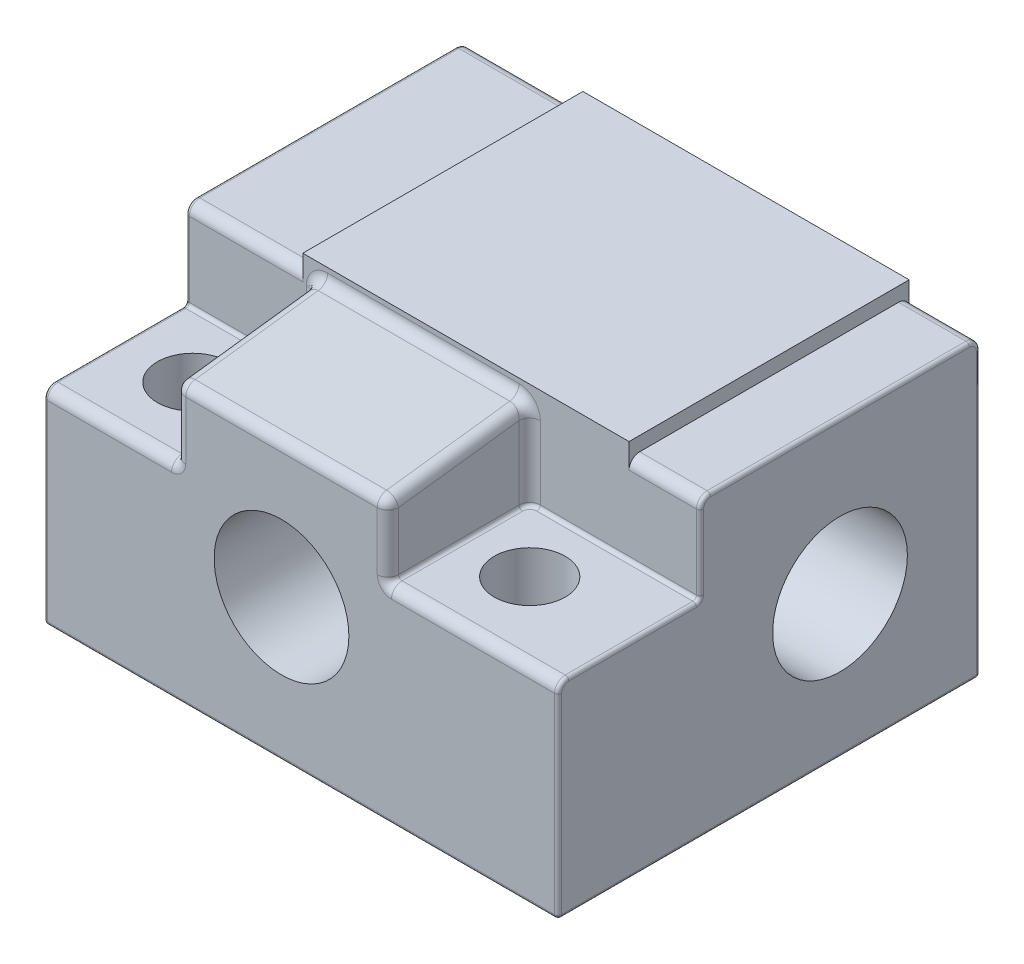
from build123d import *
from OCP.BRepFilletAPI import BRepFilletAPI_MakeFillet

# Parameters (mm, degrees)
SKETCH1_W          = 18.415
SKETCH1_H          = 15.113
EXTRUDE1_DEPTH     = 10.541
SKETCH2_W          = 6.096
SKETCH2_H          = 5.08
SKETCH2_W_2        = 4.699
CUT_EXTRUDE1_DEPTH = 3.175
SKETCH3_R          = 1.27
CUT_EXTRUDE2_DEPTH = 25.935375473
SKETCH4_W          = 11.684
SKETCH4_H          = 10.033
EXTRUDE2_DEPTH     = 0.508
SKETCH5_R          = 2.413
CUT_EXTRUDE3_DEPTH = 5.842
SKETCH6_R          = 2.413
CUT_EXTRUDE4_DEPTH = 27.260148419
CUT_EXTRUDE5_DEPTH = 27.260148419
FILLET1_R1         = 0.127
FILLET1_R2         = 0.381


with BuildPart() as part:
    # Sketch1 → Extrude1 (new body)
    with BuildSketch(Plane(origin=(0, 0, 0), x_dir=(1, 0, 0), z_dir=(0, 1, 0))):
        with Locations((9.2075, 7.5565)):
            Rectangle(SKETCH1_W, SKETCH1_H)
    extrude(amount=EXTRUDE1_DEPTH)

    # Sketch2 → Cut-Extrude1 (cut)
    with BuildSketch(Plane(origin=(0, 10.541, 0), x_dir=(-1, 0, 0), z_dir=(0, 1, 0))):
        with Locations((-15.367, -2.54)):
            Rectangle(SKETCH2_W, SKETCH2_H)
        with Locations((-2.3495, -2.54)):
            Rectangle(SKETCH2_W_2, SKETCH2_H)
    extrude(amount=-CUT_EXTRUDE1_DEPTH, mode=Mode.SUBTRACT)

    # Sketch3 → Cut-Extrude2 (cut, through all)
    with BuildSketch(Plane(origin=(0, 7.366, 0), x_dir=(-1, 0, 0), z_dir=(0, 1, 0))):
        with Locations(Location((-2.54, -2.794, 0), (0, 0, 90))):
            Circle(SKETCH3_R)
        with Locations(Location((-14.605, -2.794, 0), (0, 0, 90))):
            Circle(SKETCH3_R)
    extrude(amount=-CUT_EXTRUDE2_DEPTH, mode=Mode.SUBTRACT)

    # Sketch4 → Extrude2 (add)
    with BuildSketch(Plane(origin=(0, 10.541, 0), x_dir=(-1, 0, 0), z_dir=(0, 1, 0))):
        with Locations((-10.033, -10.0965)):
            Rectangle(SKETCH4_W, SKETCH4_H)
    extrude(amount=EXTRUDE2_DEPTH)

    # Sketch5 → Cut-Extrude3 (cut)
    with BuildSketch(Plane.XY):
        with Locations((8.509, 5.08)):
            Circle(SKETCH5_R)
    extrude(amount=-CUT_EXTRUDE3_DEPTH, mode=Mode.SUBTRACT)

    # Sketch6 → Cut-Extrude4 (cut, through all)
    with BuildSketch(Plane(origin=(18.415, 0, 0), x_dir=(0, 0, -1), z_dir=(1, 0, 0))):
        with Locations((10.0965, 5.08)):
            Circle(SKETCH6_R)
    extrude(amount=-CUT_EXTRUDE4_DEPTH, mode=Mode.SUBTRACT)

    # Sketch7 → Cut-Extrude5 (cut, through all)
    with BuildSketch(Plane(origin=(0, 0, 0), x_dir=(0, 0, -1), z_dir=(1, 0, 0))):
        Polygon((5.08, 10.541), (0, 9.906), (0, 10.541), align=None)
    extrude(amount=CUT_EXTRUDE5_DEPTH, mode=Mode.SUBTRACT)

    # Fillet1: one fillet with a radius per group of edges: ONE call of the kernel's fillet builder (fillet() takes one radius for all edges)
    fillet1_edges_1 = [part.edges().sort_by_distance(p)[0] for p in [
        (18.415, 10.541, -10.0965),
        (18.415, 3.683, 0),
        (18.415, 7.366, -2.54),
        (18.415, 8.9535, -5.08),
        (12.319, 7.366, -2.54),
        (15.367, 7.366, -5.08),
        (0, 3.683, 0),
        (0, 7.366, -2.54),
        (2.3495, 7.366, -5.08),
        (0, 8.9535, -5.08),
        (4.699, 7.366, -2.54),
        (0, 10.541, -10.0965),
        (9.2075, 0, -15.113),
        (18.415, 0, -7.5565),
        (9.2075, 0, 0),
        (0, 0, -7.5565),
        (0, 5.2705, -15.113),
        (18.415, 5.2705, -15.113),
    ]]
    fillet1_edges_2 = [part.edges().sort_by_distance(p)[0] for p in [
        (17.145, 10.541, -15.113),
        (15.367, 7.366, 0),
        (12.319, 8.636, 0),
        (12.319, 8.9535, -5.08),
        (17.145, 10.541, -5.08),
        (4.699, 8.9535, -5.08),
        (2.3495, 7.366, 0),
        (4.699, 8.636, 0),
        (2.0955, 10.541, -5.08),
        (2.0955, 10.541, -15.113),
        (8.509, 10.541, -5.08),
        (8.509, 9.906, 0),
        (12.319, 10.2235, -2.54),
        (4.699, 10.2235, -2.54),
    ]]
    fillet1 = BRepFilletAPI_MakeFillet(part.part.solid().wrapped)
    for e in fillet1_edges_1:
        fillet1.Add(FILLET1_R1, e.wrapped)
    for e in fillet1_edges_2:
        fillet1.Add(FILLET1_R2, e.wrapped)
    add(Compound.cast(fillet1.Shape()), mode=Mode.REPLACE)


solid = part.part
